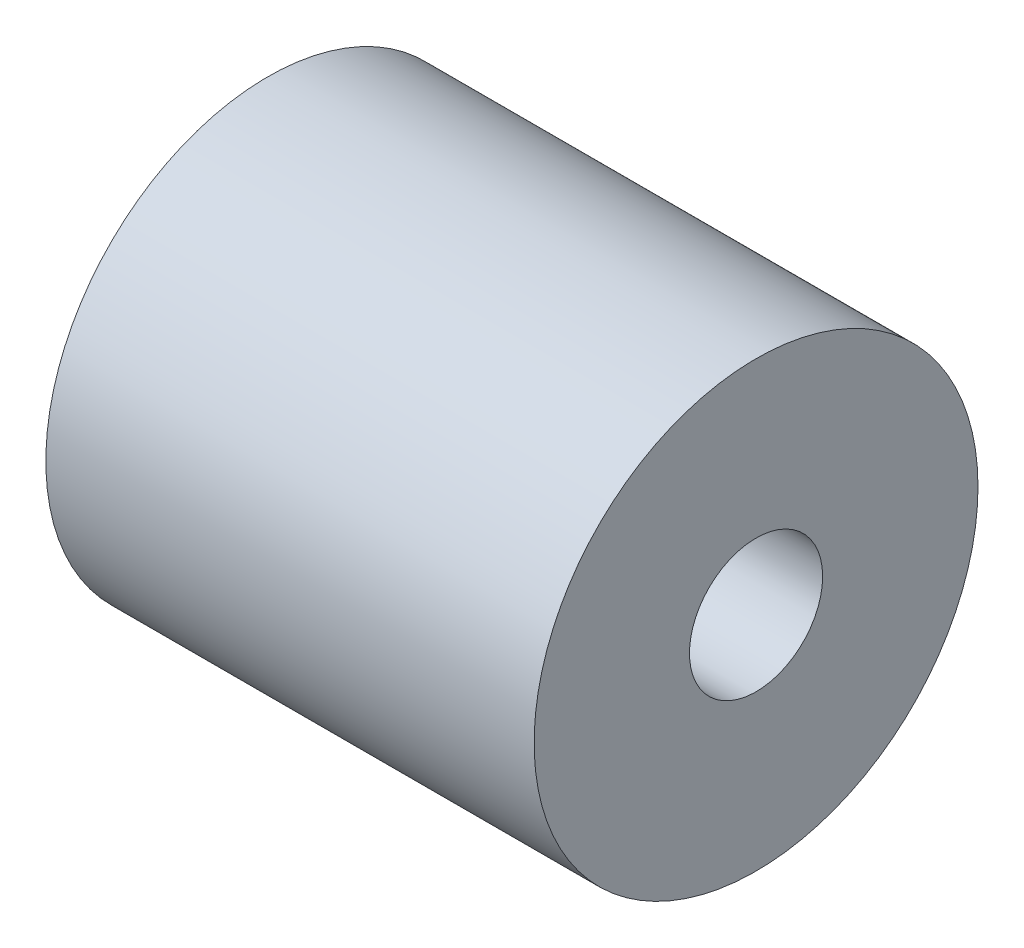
ISO-10303-21;
HEADER;
FILE_DESCRIPTION(('STEP AP214'),'2;1');
FILE_NAME('part.step','',(''),(''),'','','');
FILE_SCHEMA(('AUTOMOTIVE_DESIGN { 1 0 10303 214 1 1 1 1 }'));
ENDSEC;
DATA;
#1=APPLICATION_CONTEXT('core data for automotive mechanical design processes');
#2=APPLICATION_PROTOCOL_DEFINITION('international standard','automotive_design',2000,#1);
#3=PRODUCT_CONTEXT('',#1,'mechanical');
#4=PRODUCT('Part','Part','',(#3));
#5=PRODUCT_RELATED_PRODUCT_CATEGORY('part','',(#4));
#6=PRODUCT_DEFINITION_FORMATION('','',#4);
#7=PRODUCT_DEFINITION_CONTEXT('part definition',#1,'design');
#8=PRODUCT_DEFINITION('design','',#6,#7);
#9=PRODUCT_DEFINITION_SHAPE('','',#8);
#10=(LENGTH_UNIT() NAMED_UNIT(*) SI_UNIT(.MILLI.,.METRE.));
#11=(NAMED_UNIT(*) PLANE_ANGLE_UNIT() SI_UNIT($,.RADIAN.));
#12=(NAMED_UNIT(*) SI_UNIT($,.STERADIAN.) SOLID_ANGLE_UNIT());
#13=UNCERTAINTY_MEASURE_WITH_UNIT(LENGTH_MEASURE(1.E-05),#10,'distance_accuracy_value','');
#14=(GEOMETRIC_REPRESENTATION_CONTEXT(3) GLOBAL_UNCERTAINTY_ASSIGNED_CONTEXT((#13)) GLOBAL_UNIT_ASSIGNED_CONTEXT((#10,
#11,#12)) REPRESENTATION_CONTEXT('',''));
#15=CARTESIAN_POINT('',(0.,0.,0.));
#16=DIRECTION('',(0.,0.,1.));
#17=DIRECTION('',(1.,0.,0.));
#18=AXIS2_PLACEMENT_3D('',#15,#16,#17);
#19=CARTESIAN_POINT('',(13.97,0.,0.));
#20=DIRECTION('',(1.,0.,0.));
#21=DIRECTION('',(0.,0.,-1.));
#22=AXIS2_PLACEMENT_3D('',#19,#20,#21);
#23=PLANE('',#22);
#24=CARTESIAN_POINT('',(13.97,0.,0.));
#25=DIRECTION('',(1.,0.,0.));
#26=DIRECTION('',(0.,0.,-1.));
#27=AXIS2_PLACEMENT_3D('',#24,#25,#26);
#28=CIRCLE('',#27,6.35);
#29=CARTESIAN_POINT('',(13.97,0.,-6.35));
#30=VERTEX_POINT('',#29);
#31=EDGE_CURVE('E10',#30,#30,#28,.T.);
#32=ORIENTED_EDGE('',*,*,#31,.T.);
#33=EDGE_LOOP('',(#32));
#34=FACE_BOUND('',#33,.T.);
#35=CARTESIAN_POINT('',(13.97,0.,0.));
#36=DIRECTION('',(1.,0.,0.));
#37=DIRECTION('',(0.,0.,-1.));
#38=AXIS2_PLACEMENT_3D('',#35,#36,#37);
#39=CIRCLE('',#38,1.905);
#40=CARTESIAN_POINT('',(13.97,0.,-1.905));
#41=VERTEX_POINT('',#40);
#42=EDGE_CURVE('E41',#41,#41,#39,.T.);
#43=ORIENTED_EDGE('',*,*,#42,.F.);
#44=EDGE_LOOP('',(#43));
#45=FACE_BOUND('',#44,.T.);
#46=ADVANCED_FACE('F30',(#34,#45),#23,.T.);
#47=CARTESIAN_POINT('',(0.,0.,0.));
#48=DIRECTION('',(1.,0.,0.));
#49=DIRECTION('',(0.,0.,-1.));
#50=AXIS2_PLACEMENT_3D('',#47,#48,#49);
#51=PLANE('',#50);
#52=CARTESIAN_POINT('',(0.,0.,0.));
#53=DIRECTION('',(1.,0.,0.));
#54=DIRECTION('',(0.,0.,-1.));
#55=AXIS2_PLACEMENT_3D('',#52,#53,#54);
#56=CIRCLE('',#55,6.35);
#57=CARTESIAN_POINT('',(0.,0.,-6.35));
#58=VERTEX_POINT('',#57);
#59=EDGE_CURVE('E34',#58,#58,#56,.T.);
#60=ORIENTED_EDGE('',*,*,#59,.F.);
#61=EDGE_LOOP('',(#60));
#62=FACE_BOUND('',#61,.T.);
#63=CARTESIAN_POINT('',(0.,0.,0.));
#64=DIRECTION('',(1.,0.,0.));
#65=DIRECTION('',(0.,0.,-1.));
#66=AXIS2_PLACEMENT_3D('',#63,#64,#65);
#67=CIRCLE('',#66,1.905);
#68=CARTESIAN_POINT('',(0.,0.,-1.905));
#69=VERTEX_POINT('',#68);
#70=EDGE_CURVE('E43',#69,#69,#67,.T.);
#71=ORIENTED_EDGE('',*,*,#70,.T.);
#72=EDGE_LOOP('',(#71));
#73=FACE_BOUND('',#72,.T.);
#74=ADVANCED_FACE('F53',(#62,#73),#51,.F.);
#75=CARTESIAN_POINT('',(13.97,0.,0.));
#76=DIRECTION('',(-1.,0.,0.));
#77=DIRECTION('',(0.,0.,1.));
#78=AXIS2_PLACEMENT_3D('',#75,#76,#77);
#79=CYLINDRICAL_SURFACE('',#78,6.35);
#80=ORIENTED_EDGE('',*,*,#31,.F.);
#81=EDGE_LOOP('',(#80));
#82=FACE_BOUND('',#81,.T.);
#83=ORIENTED_EDGE('',*,*,#59,.T.);
#84=EDGE_LOOP('',(#83));
#85=FACE_BOUND('',#84,.T.);
#86=ADVANCED_FACE('F32',(#82,#85),#79,.T.);
#87=CARTESIAN_POINT('',(13.97,0.,0.));
#88=DIRECTION('',(-1.,0.,0.));
#89=DIRECTION('',(0.,0.,1.));
#90=AXIS2_PLACEMENT_3D('',#87,#88,#89);
#91=CYLINDRICAL_SURFACE('',#90,1.905);
#92=ORIENTED_EDGE('',*,*,#42,.T.);
#93=EDGE_LOOP('',(#92));
#94=FACE_BOUND('',#93,.T.);
#95=ORIENTED_EDGE('',*,*,#70,.F.);
#96=EDGE_LOOP('',(#95));
#97=FACE_BOUND('',#96,.T.);
#98=ADVANCED_FACE('F49',(#94,#97),#91,.F.);
#99=CLOSED_SHELL('',(#46,#74,#86,#98));
#100=MANIFOLD_SOLID_BREP('B2',#99);
#101=ADVANCED_BREP_SHAPE_REPRESENTATION('',(#18,#100),#14);
#102=SHAPE_DEFINITION_REPRESENTATION(#9,#101);
ENDSEC;
END-ISO-10303-21;
